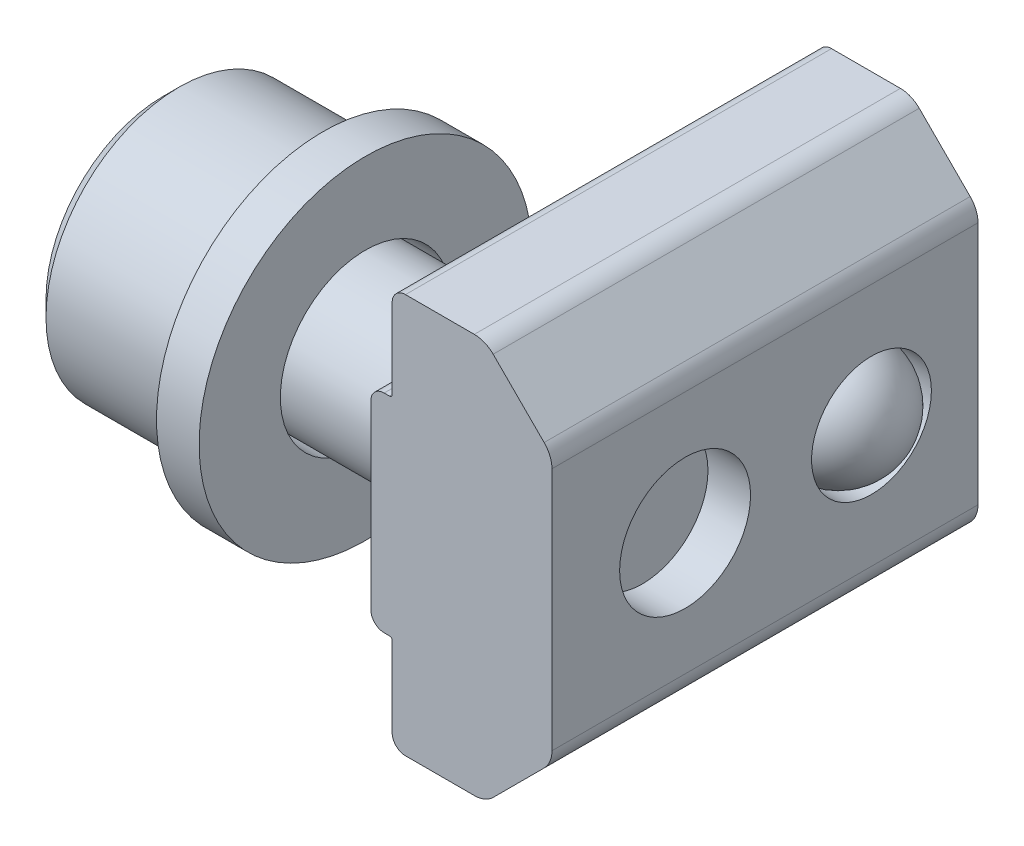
from build123d import *

# Parameters (mm, degrees)
CUT_EXTRUDE1_DEPTH  = 3
SKETCH3_R           = 6.25
SKETCH3_R_2         = 3.2
BOSS_EXTRUDE1_DEPTH = 1.6
BOSS_EXTRUDE2_START = 5
BOSS_EXTRUDE2_DEPTH = 16
SKETCH5_W           = 1.25
SKETCH5_H           = 2.25
SKETCH8_W           = 2.4585
SKETCH8_H           = 7.8


with BuildPart() as part:
    # Sketch1 → Revolve1 (revolve)
    with BuildSketch(Plane.XY, mode=Mode.PRIVATE) as revolve1_sk:
        Polygon((-4.6, 2.5), (-3.156624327, 0), (10.4, 0), (10.4, 3), (-1.6, 3), (-1.6, 5), (-7, 5), (-7.6, 4.4), (-7.6, 2.5), align=None)
    revolve(revolve1_sk.sketch.rotate(Axis((-3.156624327, 0, 0), (1, 0, 0)), 90), axis=Axis((-3.156624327, 0, 0), (1, 0, 0)))

    # Sketch2 → Cut-Extrude1 (cut)
    with BuildSketch(Plane.ZY.offset(7.6)):
        Polygon((0, 2.886751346), (-2.5, 1.443375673), (-2.5, -1.443375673), (0, -2.886751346), (2.5, -1.443375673), (2.5, 1.443375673), align=None)
    extrude(amount=-CUT_EXTRUDE1_DEPTH, mode=Mode.SUBTRACT)


with BuildPart() as body_2:
    # Sketch3 → Boss-Extrude1 (new body)
    with BuildSketch(Plane(origin=(0, 0, 0), x_dir=(0, 0, -1), z_dir=(1, 0, 0))):
        Circle(SKETCH3_R)
        Circle(SKETCH3_R_2, mode=Mode.SUBTRACT)
    extrude(amount=-BOSS_EXTRUDE1_DEPTH)


with BuildPart() as body_3:
    # Sketch4 → Boss-Extrude2 (new body)
    with BuildSketch(Plane.XY.offset(BOSS_EXTRUDE2_START)):
        with BuildLine():
            Line((11.707106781, 5.292893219), (9.792893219, 7.207106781))
            ThreePointArc((9.792893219, 7.207106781), (9.46846987, 7.423879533), (9.085786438, 7.5))
            Line((9.085786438, 7.5), (6.5, 7.5))
            ThreePointArc((6.5, 7.5), (6.146446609, 7.353553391), (6, 7))
            Line((6, 7), (6, 4))
            ThreePointArc((6, 4), (5.970710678, 3.929289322), (5.9, 3.9))
            Line((5.9, 3.9), (5.7, 3.9))
            ThreePointArc((5.7, 3.9), (5.346446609, 3.753553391), (5.2, 3.4))
            Line((5.2, 3.4), (5.2, -3.4))
            ThreePointArc((5.2, -3.4), (5.346446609, -3.753553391), (5.7, -3.9))
            Line((5.7, -3.9), (5.9, -3.9))
            ThreePointArc((5.9, -3.9), (5.970710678, -3.929289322), (6, -4))
            Line((6, -4), (6, -7))
            ThreePointArc((6, -7), (6.146446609, -7.353553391), (6.5, -7.5))
            Line((6.5, -7.5), (9.085786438, -7.5))
            ThreePointArc((9.085786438, -7.5), (9.46846987, -7.423879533), (9.792893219, -7.207106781))
            Line((9.792893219, -7.207106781), (11.707106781, -5.292893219))
            ThreePointArc((11.707106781, -5.292893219), (11.923879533, -4.96846987), (12, -4.585786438))
            Line((12, -4.585786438), (12, 4.585786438))
            ThreePointArc((12, 4.585786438), (11.923879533, 4.96846987), (11.707106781, 5.292893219))
        make_face()
    extrude(amount=-BOSS_EXTRUDE2_DEPTH)

    # Sketch5 → Cut-Revolve1 (revolve, cut)
    with BuildSketch(Plane(origin=(0, 0, -7), x_dir=(1, 0, 0), z_dir=(0, 1, 0))):
        with Locations((11.375, 1.125)):
            Rectangle(SKETCH5_W, SKETCH5_H)
    revolve(axis=Axis((12, 0, -7), (-1, 0, 0)), mode=Mode.SUBTRACT)

    # Sketch6 → Revolve2 (revolve)
    with BuildSketch(Plane(origin=(0, 0, -7), x_dir=(1, 0, 0), z_dir=(0, 1, 0))):
        with BuildLine():
            Line((10.75, 0), (10.75, 2.25))
            ThreePointArc((10.75, 2.25), (12.340990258, 1.590990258), (13, 0))
            Line((13, 0), (10.75, 0))
        make_face()
    revolve(axis=Axis((10.75, 0, -7), (1, 0, 0)))

    # Sketch8 → Tap1 (revolve, cut)
    with BuildSketch(Plane(origin=(5.2, 0, 0), x_dir=(0, 0, 1), z_dir=(0, 1, 0))):
        with Locations((1.22925, 3.9)):
            Rectangle(SKETCH8_W, SKETCH8_H)
    revolve(axis=Axis((5.2, 0, 0), (1, 0, 0)), mode=Mode.SUBTRACT)


solid = Compound([part.part, body_2.part, body_3.part])
